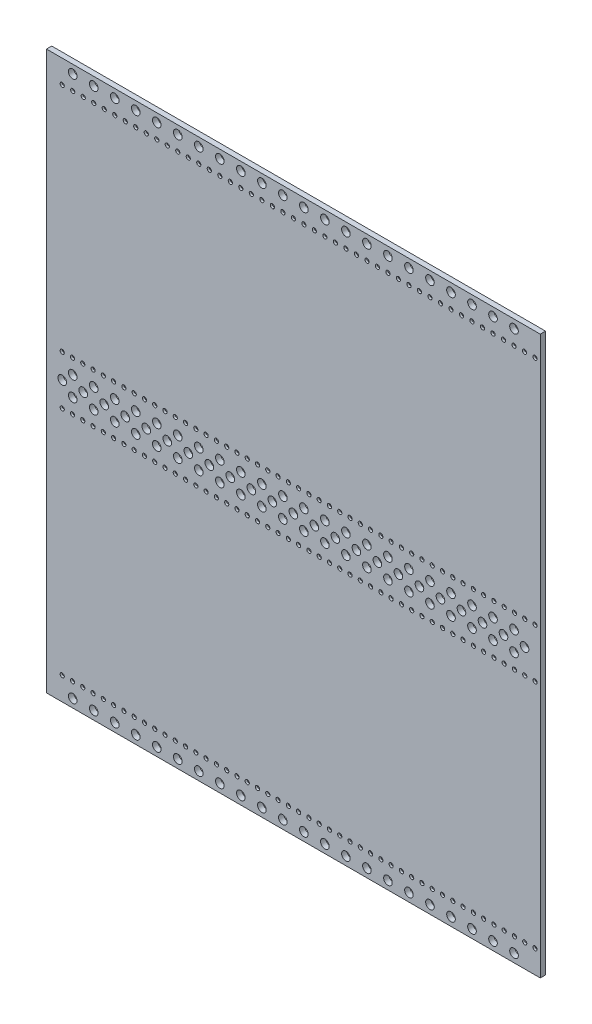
from build123d import *

# Parameters (mm, degrees)
SKETCH_1_W          = 235
SKETCH_1_H          = 265.35
SKETCH_1_R          = 2.05
EXTRUDE_1_DEPTH     = 1.25
SKETCH_2_R          = 1
CUT_EXTRUDE_1_DEPTH = 1
SKETCH_3_R          = 1
EXTRUDE_2_DEPTH     = 1


with BuildPart() as part:
    # Sketch 1 → Extrude 1 (new, symmetric)
    with BuildSketch(Plane.XY):
        Rectangle(SKETCH_1_W, SKETCH_1_H)
        with Locations((-105, 128.675)):
            Circle(SKETCH_1_R, mode=Mode.SUBTRACT)
        with Locations((-95, 128.675)):
            Circle(SKETCH_1_R, mode=Mode.SUBTRACT)
        with Locations((-85, 128.675)):
            Circle(SKETCH_1_R, mode=Mode.SUBTRACT)
        with Locations((-75, 128.675)):
            Circle(SKETCH_1_R, mode=Mode.SUBTRACT)
        with Locations((-65, 128.675)):
            Circle(SKETCH_1_R, mode=Mode.SUBTRACT)
        with Locations((-55, 128.675)):
            Circle(SKETCH_1_R, mode=Mode.SUBTRACT)
        with Locations((-45, 128.675)):
            Circle(SKETCH_1_R, mode=Mode.SUBTRACT)
        with Locations((-35, 128.675)):
            Circle(SKETCH_1_R, mode=Mode.SUBTRACT)
        with Locations((-25, 128.675)):
            Circle(SKETCH_1_R, mode=Mode.SUBTRACT)
        with Locations((-15, 128.675)):
            Circle(SKETCH_1_R, mode=Mode.SUBTRACT)
        with Locations((-5, 128.675)):
            Circle(SKETCH_1_R, mode=Mode.SUBTRACT)
        with Locations((5, 128.675)):
            Circle(SKETCH_1_R, mode=Mode.SUBTRACT)
        with Locations((15, 128.675)):
            Circle(SKETCH_1_R, mode=Mode.SUBTRACT)
        with Locations((25, 128.675)):
            Circle(SKETCH_1_R, mode=Mode.SUBTRACT)
        with Locations((35, 128.675)):
            Circle(SKETCH_1_R, mode=Mode.SUBTRACT)
        with Locations((45, 128.675)):
            Circle(SKETCH_1_R, mode=Mode.SUBTRACT)
        with Locations((55, 128.675)):
            Circle(SKETCH_1_R, mode=Mode.SUBTRACT)
        with Locations((65, 128.675)):
            Circle(SKETCH_1_R, mode=Mode.SUBTRACT)
        with Locations((75, 128.675)):
            Circle(SKETCH_1_R, mode=Mode.SUBTRACT)
        with Locations((85, 128.675)):
            Circle(SKETCH_1_R, mode=Mode.SUBTRACT)
        with Locations((95, 128.675)):
            Circle(SKETCH_1_R, mode=Mode.SUBTRACT)
        with Locations((105, 128.675)):
            Circle(SKETCH_1_R, mode=Mode.SUBTRACT)
        with Locations((-105, 4.675)):
            Circle(SKETCH_1_R, mode=Mode.SUBTRACT)
        with Locations((-105, -4.675)):
            Circle(SKETCH_1_R, mode=Mode.SUBTRACT)
        with Locations((-105, -128.675)):
            Circle(SKETCH_1_R, mode=Mode.SUBTRACT)
        with Locations((-95, 4.675)):
            Circle(SKETCH_1_R, mode=Mode.SUBTRACT)
        with Locations((-95, -4.675)):
            Circle(SKETCH_1_R, mode=Mode.SUBTRACT)
        with Locations((-95, -128.675)):
            Circle(SKETCH_1_R, mode=Mode.SUBTRACT)
        with Locations((-85, 4.675)):
            Circle(SKETCH_1_R, mode=Mode.SUBTRACT)
        with Locations((-85, -4.675)):
            Circle(SKETCH_1_R, mode=Mode.SUBTRACT)
        with Locations((-85, -128.675)):
            Circle(SKETCH_1_R, mode=Mode.SUBTRACT)
        with Locations((-75, 4.675)):
            Circle(SKETCH_1_R, mode=Mode.SUBTRACT)
        with Locations((-75, -4.675)):
            Circle(SKETCH_1_R, mode=Mode.SUBTRACT)
        with Locations((-75, -128.675)):
            Circle(SKETCH_1_R, mode=Mode.SUBTRACT)
        with Locations((-65, 4.675)):
            Circle(SKETCH_1_R, mode=Mode.SUBTRACT)
        with Locations((-65, -4.675)):
            Circle(SKETCH_1_R, mode=Mode.SUBTRACT)
        with Locations((-65, -128.675)):
            Circle(SKETCH_1_R, mode=Mode.SUBTRACT)
        with Locations((-55, 4.675)):
            Circle(SKETCH_1_R, mode=Mode.SUBTRACT)
        with Locations((-55, -4.675)):
            Circle(SKETCH_1_R, mode=Mode.SUBTRACT)
        with Locations((-55, -128.675)):
            Circle(SKETCH_1_R, mode=Mode.SUBTRACT)
        with Locations((-45, 4.675)):
            Circle(SKETCH_1_R, mode=Mode.SUBTRACT)
        with Locations((-45, -4.675)):
            Circle(SKETCH_1_R, mode=Mode.SUBTRACT)
        with Locations((-45, -128.675)):
            Circle(SKETCH_1_R, mode=Mode.SUBTRACT)
        with Locations((-35, 4.675)):
            Circle(SKETCH_1_R, mode=Mode.SUBTRACT)
        with Locations((-35, -4.675)):
            Circle(SKETCH_1_R, mode=Mode.SUBTRACT)
        with Locations((-35, -128.675)):
            Circle(SKETCH_1_R, mode=Mode.SUBTRACT)
        with Locations((-25, 4.675)):
            Circle(SKETCH_1_R, mode=Mode.SUBTRACT)
        with Locations((-25, -4.675)):
            Circle(SKETCH_1_R, mode=Mode.SUBTRACT)
        with Locations((-25, -128.675)):
            Circle(SKETCH_1_R, mode=Mode.SUBTRACT)
        with Locations((-15, 4.675)):
            Circle(SKETCH_1_R, mode=Mode.SUBTRACT)
        with Locations((-15, -4.675)):
            Circle(SKETCH_1_R, mode=Mode.SUBTRACT)
        with Locations((-15, -128.675)):
            Circle(SKETCH_1_R, mode=Mode.SUBTRACT)
        with Locations((-5, 4.675)):
            Circle(SKETCH_1_R, mode=Mode.SUBTRACT)
        with Locations((-5, -4.675)):
            Circle(SKETCH_1_R, mode=Mode.SUBTRACT)
        with Locations((-5, -128.675)):
            Circle(SKETCH_1_R, mode=Mode.SUBTRACT)
        with Locations((5, 4.675)):
            Circle(SKETCH_1_R, mode=Mode.SUBTRACT)
        with Locations((5, -4.675)):
            Circle(SKETCH_1_R, mode=Mode.SUBTRACT)
        with Locations((5, -128.675)):
            Circle(SKETCH_1_R, mode=Mode.SUBTRACT)
        with Locations((15, 4.675)):
            Circle(SKETCH_1_R, mode=Mode.SUBTRACT)
        with Locations((15, -4.675)):
            Circle(SKETCH_1_R, mode=Mode.SUBTRACT)
        with Locations((15, -128.675)):
            Circle(SKETCH_1_R, mode=Mode.SUBTRACT)
        with Locations((25, 4.675)):
            Circle(SKETCH_1_R, mode=Mode.SUBTRACT)
        with Locations((25, -4.675)):
            Circle(SKETCH_1_R, mode=Mode.SUBTRACT)
        with Locations((25, -128.675)):
            Circle(SKETCH_1_R, mode=Mode.SUBTRACT)
        with Locations((35, 4.675)):
            Circle(SKETCH_1_R, mode=Mode.SUBTRACT)
        with Locations((35, -4.675)):
            Circle(SKETCH_1_R, mode=Mode.SUBTRACT)
        with Locations((35, -128.675)):
            Circle(SKETCH_1_R, mode=Mode.SUBTRACT)
        with Locations((45, 4.675)):
            Circle(SKETCH_1_R, mode=Mode.SUBTRACT)
        with Locations((45, -4.675)):
            Circle(SKETCH_1_R, mode=Mode.SUBTRACT)
        with Locations((45, -128.675)):
            Circle(SKETCH_1_R, mode=Mode.SUBTRACT)
        with Locations((55, 4.675)):
            Circle(SKETCH_1_R, mode=Mode.SUBTRACT)
        with Locations((55, -4.675)):
            Circle(SKETCH_1_R, mode=Mode.SUBTRACT)
        with Locations((55, -128.675)):
            Circle(SKETCH_1_R, mode=Mode.SUBTRACT)
        with Locations((65, 4.675)):
            Circle(SKETCH_1_R, mode=Mode.SUBTRACT)
        with Locations((65, -4.675)):
            Circle(SKETCH_1_R, mode=Mode.SUBTRACT)
        with Locations((65, -128.675)):
            Circle(SKETCH_1_R, mode=Mode.SUBTRACT)
        with Locations((75, 4.675)):
            Circle(SKETCH_1_R, mode=Mode.SUBTRACT)
        with Locations((75, -4.675)):
            Circle(SKETCH_1_R, mode=Mode.SUBTRACT)
        with Locations((75, -128.675)):
            Circle(SKETCH_1_R, mode=Mode.SUBTRACT)
        with Locations((85, 4.675)):
            Circle(SKETCH_1_R, mode=Mode.SUBTRACT)
        with Locations((85, -4.675)):
            Circle(SKETCH_1_R, mode=Mode.SUBTRACT)
        with Locations((85, -128.675)):
            Circle(SKETCH_1_R, mode=Mode.SUBTRACT)
        with Locations((95, 4.675)):
            Circle(SKETCH_1_R, mode=Mode.SUBTRACT)
        with Locations((95, -4.675)):
            Circle(SKETCH_1_R, mode=Mode.SUBTRACT)
        with Locations((95, -128.675)):
            Circle(SKETCH_1_R, mode=Mode.SUBTRACT)
        with Locations((105, 4.675)):
            Circle(SKETCH_1_R, mode=Mode.SUBTRACT)
        with Locations((105, -4.675)):
            Circle(SKETCH_1_R, mode=Mode.SUBTRACT)
        with Locations((105, -128.675)):
            Circle(SKETCH_1_R, mode=Mode.SUBTRACT)
        with Locations((-110, 0)):
            Circle(SKETCH_1_R, mode=Mode.SUBTRACT)
        with Locations((-100, 0)):
            Circle(SKETCH_1_R, mode=Mode.SUBTRACT)
        with Locations((-90, 0)):
            Circle(SKETCH_1_R, mode=Mode.SUBTRACT)
        with Locations((-80, 0)):
            Circle(SKETCH_1_R, mode=Mode.SUBTRACT)
        with Locations((-70, 0)):
            Circle(SKETCH_1_R, mode=Mode.SUBTRACT)
        with Locations((-60, 0)):
            Circle(SKETCH_1_R, mode=Mode.SUBTRACT)
        with Locations((-50, 0)):
            Circle(SKETCH_1_R, mode=Mode.SUBTRACT)
        with Locations((-40, 0)):
            Circle(SKETCH_1_R, mode=Mode.SUBTRACT)
        with Locations((-30, 0)):
            Circle(SKETCH_1_R, mode=Mode.SUBTRACT)
        with Locations((-20, 0)):
            Circle(SKETCH_1_R, mode=Mode.SUBTRACT)
        with Locations((-10, 0)):
            Circle(SKETCH_1_R, mode=Mode.SUBTRACT)
        Circle(SKETCH_1_R, mode=Mode.SUBTRACT)
        with Locations((10, 0)):
            Circle(SKETCH_1_R, mode=Mode.SUBTRACT)
        with Locations((20, 0)):
            Circle(SKETCH_1_R, mode=Mode.SUBTRACT)
        with Locations((30, 0)):
            Circle(SKETCH_1_R, mode=Mode.SUBTRACT)
        with Locations((40, 0)):
            Circle(SKETCH_1_R, mode=Mode.SUBTRACT)
        with Locations((50, 0)):
            Circle(SKETCH_1_R, mode=Mode.SUBTRACT)
        with Locations((60, 0)):
            Circle(SKETCH_1_R, mode=Mode.SUBTRACT)
        with Locations((70, 0)):
            Circle(SKETCH_1_R, mode=Mode.SUBTRACT)
        with Locations((80, 0)):
            Circle(SKETCH_1_R, mode=Mode.SUBTRACT)
        with Locations((90, 0)):
            Circle(SKETCH_1_R, mode=Mode.SUBTRACT)
        with Locations((100, 0)):
            Circle(SKETCH_1_R, mode=Mode.SUBTRACT)
        with Locations((110, 0)):
            Circle(SKETCH_1_R, mode=Mode.SUBTRACT)
    extrude(amount=EXTRUDE_1_DEPTH, both=True)

    # Sketch 2 → Cut-Extrude 1 (cut)
    with BuildSketch(Plane.XY.offset(1.25)):
        with Locations((-110, 121.675)):
            Circle(SKETCH_2_R)
        with Locations((-105, 121.675)):
            Circle(SKETCH_2_R)
        with Locations((-100, 121.675)):
            Circle(SKETCH_2_R)
        with Locations((-95, 121.675)):
            Circle(SKETCH_2_R)
        with Locations((-90, 121.675)):
            Circle(SKETCH_2_R)
        with Locations((-85, 121.675)):
            Circle(SKETCH_2_R)
        with Locations((-80, 121.675)):
            Circle(SKETCH_2_R)
        with Locations((-75, 121.675)):
            Circle(SKETCH_2_R)
        with Locations((-70, 121.675)):
            Circle(SKETCH_2_R)
        with Locations((-65, 121.675)):
            Circle(SKETCH_2_R)
        with Locations((-60, 121.675)):
            Circle(SKETCH_2_R)
        with Locations((-55, 121.675)):
            Circle(SKETCH_2_R)
        with Locations((-50, 121.675)):
            Circle(SKETCH_2_R)
        with Locations((-45, 121.675)):
            Circle(SKETCH_2_R)
        with Locations((-40, 121.675)):
            Circle(SKETCH_2_R)
        with Locations((-35, 121.675)):
            Circle(SKETCH_2_R)
        with Locations((-30, 121.675)):
            Circle(SKETCH_2_R)
        with Locations((-25, 121.675)):
            Circle(SKETCH_2_R)
        with Locations((-20, 121.675)):
            Circle(SKETCH_2_R)
        with Locations((-15, 121.675)):
            Circle(SKETCH_2_R)
        with Locations((-10, 121.675)):
            Circle(SKETCH_2_R)
        with Locations((-5, 121.675)):
            Circle(SKETCH_2_R)
        with Locations((0, 121.675)):
            Circle(SKETCH_2_R)
        with Locations((5, 121.675)):
            Circle(SKETCH_2_R)
        with Locations((10, 121.675)):
            Circle(SKETCH_2_R)
        with Locations((15, 121.675)):
            Circle(SKETCH_2_R)
        with Locations((20, 121.675)):
            Circle(SKETCH_2_R)
        with Locations((25, 121.675)):
            Circle(SKETCH_2_R)
        with Locations((30, 121.675)):
            Circle(SKETCH_2_R)
        with Locations((35, 121.675)):
            Circle(SKETCH_2_R)
        with Locations((40, 121.675)):
            Circle(SKETCH_2_R)
        with Locations((45, 121.675)):
            Circle(SKETCH_2_R)
        with Locations((50, 121.675)):
            Circle(SKETCH_2_R)
        with Locations((55, 121.675)):
            Circle(SKETCH_2_R)
        with Locations((60, 121.675)):
            Circle(SKETCH_2_R)
        with Locations((65, 121.675)):
            Circle(SKETCH_2_R)
        with Locations((70, 121.675)):
            Circle(SKETCH_2_R)
        with Locations((75, 121.675)):
            Circle(SKETCH_2_R)
        with Locations((80, 121.675)):
            Circle(SKETCH_2_R)
        with Locations((85, 121.675)):
            Circle(SKETCH_2_R)
        with Locations((90, 121.675)):
            Circle(SKETCH_2_R)
        with Locations((95, 121.675)):
            Circle(SKETCH_2_R)
        with Locations((100, 121.675)):
            Circle(SKETCH_2_R)
        with Locations((105, 121.675)):
            Circle(SKETCH_2_R)
        with Locations((110, 121.675)):
            Circle(SKETCH_2_R)
        with Locations((115, 121.675)):
            Circle(SKETCH_2_R)
        with Locations((120, 121.675)):
            Circle(SKETCH_2_R)
        with Locations((-110, 11.675)):
            Circle(SKETCH_2_R)
        with Locations((-110, -11.675)):
            Circle(SKETCH_2_R)
        with Locations((-110, -121.675)):
            Circle(SKETCH_2_R)
        with Locations((-105.108695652, 11.675)):
            Circle(SKETCH_2_R)
        with Locations((-105.108695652, -11.675)):
            Circle(SKETCH_2_R)
        with Locations((-105.108695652, -121.675)):
            Circle(SKETCH_2_R)
        with Locations((-100.217391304, 11.675)):
            Circle(SKETCH_2_R)
        with Locations((-100.217391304, -11.675)):
            Circle(SKETCH_2_R)
        with Locations((-100.217391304, -121.675)):
            Circle(SKETCH_2_R)
        with Locations((-95.326086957, 11.675)):
            Circle(SKETCH_2_R)
        with Locations((-95.326086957, -11.675)):
            Circle(SKETCH_2_R)
        with Locations((-95.326086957, -121.675)):
            Circle(SKETCH_2_R)
        with Locations((-90.434782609, 11.675)):
            Circle(SKETCH_2_R)
        with Locations((-90.434782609, -11.675)):
            Circle(SKETCH_2_R)
        with Locations((-90.434782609, -121.675)):
            Circle(SKETCH_2_R)
        with Locations((-85.543478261, 11.675)):
            Circle(SKETCH_2_R)
        with Locations((-85.543478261, -11.675)):
            Circle(SKETCH_2_R)
        with Locations((-85.543478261, -121.675)):
            Circle(SKETCH_2_R)
        with Locations((-80.652173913, 11.675)):
            Circle(SKETCH_2_R)
        with Locations((-80.652173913, -11.675)):
            Circle(SKETCH_2_R)
        with Locations((-80.652173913, -121.675)):
            Circle(SKETCH_2_R)
        with Locations((-75.760869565, 11.675)):
            Circle(SKETCH_2_R)
        with Locations((-75.760869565, -11.675)):
            Circle(SKETCH_2_R)
        with Locations((-75.760869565, -121.675)):
            Circle(SKETCH_2_R)
        with Locations((-70.869565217, 11.675)):
            Circle(SKETCH_2_R)
        with Locations((-70.869565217, -11.675)):
            Circle(SKETCH_2_R)
        with Locations((-70.869565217, -121.675)):
            Circle(SKETCH_2_R)
        with Locations((-65.97826087, 11.675)):
            Circle(SKETCH_2_R)
        with Locations((-65.97826087, -11.675)):
            Circle(SKETCH_2_R)
        with Locations((-65.97826087, -121.675)):
            Circle(SKETCH_2_R)
        with Locations((-61.086956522, 11.675)):
            Circle(SKETCH_2_R)
        with Locations((-61.086956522, -11.675)):
            Circle(SKETCH_2_R)
        with Locations((-61.086956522, -121.675)):
            Circle(SKETCH_2_R)
        with Locations((-56.195652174, 11.675)):
            Circle(SKETCH_2_R)
        with Locations((-56.195652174, -11.675)):
            Circle(SKETCH_2_R)
        with Locations((-56.195652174, -121.675)):
            Circle(SKETCH_2_R)
        with Locations((-51.304347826, 11.675)):
            Circle(SKETCH_2_R)
        with Locations((-51.304347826, -11.675)):
            Circle(SKETCH_2_R)
        with Locations((-51.304347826, -121.675)):
            Circle(SKETCH_2_R)
        with Locations((-46.413043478, 11.675)):
            Circle(SKETCH_2_R)
        with Locations((-46.413043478, -11.675)):
            Circle(SKETCH_2_R)
        with Locations((-46.413043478, -121.675)):
            Circle(SKETCH_2_R)
        with Locations((-41.52173913, 11.675)):
            Circle(SKETCH_2_R)
        with Locations((-41.52173913, -11.675)):
            Circle(SKETCH_2_R)
        with Locations((-41.52173913, -121.675)):
            Circle(SKETCH_2_R)
        with Locations((-36.630434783, 11.675)):
            Circle(SKETCH_2_R)
        with Locations((-36.630434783, -11.675)):
            Circle(SKETCH_2_R)
        with Locations((-36.630434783, -121.675)):
            Circle(SKETCH_2_R)
        with Locations((-31.739130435, 11.675)):
            Circle(SKETCH_2_R)
        with Locations((-31.739130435, -11.675)):
            Circle(SKETCH_2_R)
        with Locations((-31.739130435, -121.675)):
            Circle(SKETCH_2_R)
        with Locations((-26.847826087, 11.675)):
            Circle(SKETCH_2_R)
        with Locations((-26.847826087, -11.675)):
            Circle(SKETCH_2_R)
        with Locations((-26.847826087, -121.675)):
            Circle(SKETCH_2_R)
        with Locations((-21.956521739, 11.675)):
            Circle(SKETCH_2_R)
        with Locations((-21.956521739, -11.675)):
            Circle(SKETCH_2_R)
        with Locations((-21.956521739, -121.675)):
            Circle(SKETCH_2_R)
        with Locations((-17.065217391, 11.675)):
            Circle(SKETCH_2_R)
        with Locations((-17.065217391, -11.675)):
            Circle(SKETCH_2_R)
        with Locations((-17.065217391, -121.675)):
            Circle(SKETCH_2_R)
        with Locations((-12.173913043, 11.675)):
            Circle(SKETCH_2_R)
        with Locations((-12.173913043, -11.675)):
            Circle(SKETCH_2_R)
        with Locations((-12.173913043, -121.675)):
            Circle(SKETCH_2_R)
        with Locations((-7.282608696, 11.675)):
            Circle(SKETCH_2_R)
        with Locations((-7.282608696, -11.675)):
            Circle(SKETCH_2_R)
        with Locations((-7.282608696, -121.675)):
            Circle(SKETCH_2_R)
        with Locations((-2.391304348, 11.675)):
            Circle(SKETCH_2_R)
        with Locations((-2.391304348, -11.675)):
            Circle(SKETCH_2_R)
        with Locations((-2.391304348, -121.675)):
            Circle(SKETCH_2_R)
        with Locations((2.5, 11.675)):
            Circle(SKETCH_2_R)
        with Locations((2.5, -11.675)):
            Circle(SKETCH_2_R)
        with Locations((2.5, -121.675)):
            Circle(SKETCH_2_R)
        with Locations((7.391304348, 11.675)):
            Circle(SKETCH_2_R)
        with Locations((7.391304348, -11.675)):
            Circle(SKETCH_2_R)
        with Locations((7.391304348, -121.675)):
            Circle(SKETCH_2_R)
        with Locations((12.282608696, 11.675)):
            Circle(SKETCH_2_R)
        with Locations((12.282608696, -11.675)):
            Circle(SKETCH_2_R)
        with Locations((12.282608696, -121.675)):
            Circle(SKETCH_2_R)
        with Locations((17.173913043, 11.675)):
            Circle(SKETCH_2_R)
        with Locations((17.173913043, -11.675)):
            Circle(SKETCH_2_R)
        with Locations((17.173913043, -121.675)):
            Circle(SKETCH_2_R)
        with Locations((22.065217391, 11.675)):
            Circle(SKETCH_2_R)
        with Locations((22.065217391, -11.675)):
            Circle(SKETCH_2_R)
        with Locations((22.065217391, -121.675)):
            Circle(SKETCH_2_R)
        with Locations((26.956521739, 11.675)):
            Circle(SKETCH_2_R)
        with Locations((26.956521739, -11.675)):
            Circle(SKETCH_2_R)
        with Locations((26.956521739, -121.675)):
            Circle(SKETCH_2_R)
        with Locations((31.847826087, 11.675)):
            Circle(SKETCH_2_R)
        with Locations((31.847826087, -11.675)):
            Circle(SKETCH_2_R)
        with Locations((31.847826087, -121.675)):
            Circle(SKETCH_2_R)
        with Locations((36.739130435, 11.675)):
            Circle(SKETCH_2_R)
        with Locations((36.739130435, -11.675)):
            Circle(SKETCH_2_R)
        with Locations((36.739130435, -121.675)):
            Circle(SKETCH_2_R)
        with Locations((41.630434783, 11.675)):
            Circle(SKETCH_2_R)
        with Locations((41.630434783, -11.675)):
            Circle(SKETCH_2_R)
        with Locations((41.630434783, -121.675)):
            Circle(SKETCH_2_R)
        with Locations((46.52173913, 11.675)):
            Circle(SKETCH_2_R)
        with Locations((46.52173913, -11.675)):
            Circle(SKETCH_2_R)
        with Locations((46.52173913, -121.675)):
            Circle(SKETCH_2_R)
        with Locations((51.413043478, 11.675)):
            Circle(SKETCH_2_R)
        with Locations((51.413043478, -11.675)):
            Circle(SKETCH_2_R)
        with Locations((51.413043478, -121.675)):
            Circle(SKETCH_2_R)
        with Locations((56.304347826, 11.675)):
            Circle(SKETCH_2_R)
        with Locations((56.304347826, -11.675)):
            Circle(SKETCH_2_R)
        with Locations((56.304347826, -121.675)):
            Circle(SKETCH_2_R)
        with Locations((61.195652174, 11.675)):
            Circle(SKETCH_2_R)
        with Locations((61.195652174, -11.675)):
            Circle(SKETCH_2_R)
        with Locations((61.195652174, -121.675)):
            Circle(SKETCH_2_R)
        with Locations((66.086956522, 11.675)):
            Circle(SKETCH_2_R)
        with Locations((66.086956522, -11.675)):
            Circle(SKETCH_2_R)
        with Locations((66.086956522, -121.675)):
            Circle(SKETCH_2_R)
        with Locations((70.97826087, 11.675)):
            Circle(SKETCH_2_R)
        with Locations((70.97826087, -11.675)):
            Circle(SKETCH_2_R)
        with Locations((70.97826087, -121.675)):
            Circle(SKETCH_2_R)
        with Locations((75.869565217, 11.675)):
            Circle(SKETCH_2_R)
        with Locations((75.869565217, -11.675)):
            Circle(SKETCH_2_R)
        with Locations((75.869565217, -121.675)):
            Circle(SKETCH_2_R)
        with Locations((80.760869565, 11.675)):
            Circle(SKETCH_2_R)
        with Locations((80.760869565, -11.675)):
            Circle(SKETCH_2_R)
        with Locations((80.760869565, -121.675)):
            Circle(SKETCH_2_R)
        with Locations((85.652173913, 11.675)):
            Circle(SKETCH_2_R)
        with Locations((85.652173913, -11.675)):
            Circle(SKETCH_2_R)
        with Locations((85.652173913, -121.675)):
            Circle(SKETCH_2_R)
        with Locations((90.543478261, 11.675)):
            Circle(SKETCH_2_R)
        with Locations((90.543478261, -11.675)):
            Circle(SKETCH_2_R)
        with Locations((90.543478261, -121.675)):
            Circle(SKETCH_2_R)
        with Locations((95.434782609, 11.675)):
            Circle(SKETCH_2_R)
        with Locations((95.434782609, -11.675)):
            Circle(SKETCH_2_R)
        with Locations((95.434782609, -121.675)):
            Circle(SKETCH_2_R)
        with Locations((100.326086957, 11.675)):
            Circle(SKETCH_2_R)
        with Locations((100.326086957, -11.675)):
            Circle(SKETCH_2_R)
        with Locations((100.326086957, -121.675)):
            Circle(SKETCH_2_R)
        with Locations((105.217391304, 11.675)):
            Circle(SKETCH_2_R)
        with Locations((105.217391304, -11.675)):
            Circle(SKETCH_2_R)
        with Locations((105.217391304, -121.675)):
            Circle(SKETCH_2_R)
        with Locations((110.108695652, 11.675)):
            Circle(SKETCH_2_R)
        with Locations((110.108695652, -11.675)):
            Circle(SKETCH_2_R)
        with Locations((110.108695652, -121.675)):
            Circle(SKETCH_2_R)
        with Locations((115, 11.675)):
            Circle(SKETCH_2_R)
        with Locations((115, -11.675)):
            Circle(SKETCH_2_R)
        with Locations((115, -121.675)):
            Circle(SKETCH_2_R)
    extrude(amount=-CUT_EXTRUDE_1_DEPTH, mode=Mode.SUBTRACT)

    # Sketch 3 → Extrude 2 (add)
    with BuildSketch(Plane(origin=(0, 0, -1.25), x_dir=(-1, 0, 0), z_dir=(0, 0, -1))):
        with Locations(Location((110, 121.675, 0), (0, 0, 180))):
            Circle(SKETCH_3_R)
        with Locations(Location((110, 11.675, 0), (0, 0, 180))):
            Circle(SKETCH_3_R)
        with Locations(Location((110, -11.675, 0), (0, 0, 180))):
            Circle(SKETCH_3_R)
        with Locations(Location((110, -121.675, 0), (0, 0, 180))):
            Circle(SKETCH_3_R)
        with Locations(Location((105.217391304, 121.675, 0), (0, 0, 180))):
            Circle(SKETCH_3_R)
        with Locations(Location((105.217391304, 11.675, 0), (0, 0, 180))):
            Circle(SKETCH_3_R)
        with Locations(Location((105.217391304, -11.675, 0), (0, 0, 180))):
            Circle(SKETCH_3_R)
        with Locations(Location((105.217391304, -121.675, 0), (0, 0, 180))):
            Circle(SKETCH_3_R)
        with Locations(Location((100.434782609, 121.675, 0), (0, 0, 180))):
            Circle(SKETCH_3_R)
        with Locations(Location((100.434782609, 11.675, 0), (0, 0, 180))):
            Circle(SKETCH_3_R)
        with Locations(Location((100.434782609, -11.675, 0), (0, 0, 180))):
            Circle(SKETCH_3_R)
        with Locations(Location((100.434782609, -121.675, 0), (0, 0, 180))):
            Circle(SKETCH_3_R)
        with Locations(Location((95.652173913, 121.675, 0), (0, 0, 180))):
            Circle(SKETCH_3_R)
        with Locations(Location((95.652173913, 11.675, 0), (0, 0, 180))):
            Circle(SKETCH_3_R)
        with Locations(Location((95.652173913, -11.675, 0), (0, 0, 180))):
            Circle(SKETCH_3_R)
        with Locations(Location((95.652173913, -121.675, 0), (0, 0, 180))):
            Circle(SKETCH_3_R)
        with Locations(Location((90.869565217, 121.675, 0), (0, 0, 180))):
            Circle(SKETCH_3_R)
        with Locations(Location((90.869565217, 11.675, 0), (0, 0, 180))):
            Circle(SKETCH_3_R)
        with Locations(Location((90.869565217, -11.675, 0), (0, 0, 180))):
            Circle(SKETCH_3_R)
        with Locations(Location((90.869565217, -121.675, 0), (0, 0, 180))):
            Circle(SKETCH_3_R)
        with Locations(Location((86.086956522, 121.675, 0), (0, 0, 180))):
            Circle(SKETCH_3_R)
        with Locations(Location((86.086956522, 11.675, 0), (0, 0, 180))):
            Circle(SKETCH_3_R)
        with Locations(Location((86.086956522, -11.675, 0), (0, 0, 180))):
            Circle(SKETCH_3_R)
        with Locations(Location((86.086956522, -121.675, 0), (0, 0, 180))):
            Circle(SKETCH_3_R)
        with Locations(Location((81.304347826, 121.675, 0), (0, 0, 180))):
            Circle(SKETCH_3_R)
        with Locations(Location((81.304347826, 11.675, 0), (0, 0, 180))):
            Circle(SKETCH_3_R)
        with Locations(Location((81.304347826, -11.675, 0), (0, 0, 180))):
            Circle(SKETCH_3_R)
        with Locations(Location((81.304347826, -121.675, 0), (0, 0, 180))):
            Circle(SKETCH_3_R)
        with Locations(Location((76.52173913, 121.675, 0), (0, 0, 180))):
            Circle(SKETCH_3_R)
        with Locations(Location((76.52173913, 11.675, 0), (0, 0, 180))):
            Circle(SKETCH_3_R)
        with Locations(Location((76.52173913, -11.675, 0), (0, 0, 180))):
            Circle(SKETCH_3_R)
        with Locations(Location((76.52173913, -121.675, 0), (0, 0, 180))):
            Circle(SKETCH_3_R)
        with Locations(Location((71.739130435, 121.675, 0), (0, 0, 180))):
            Circle(SKETCH_3_R)
        with Locations(Location((71.739130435, 11.675, 0), (0, 0, 180))):
            Circle(SKETCH_3_R)
        with Locations(Location((71.739130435, -11.675, 0), (0, 0, 180))):
            Circle(SKETCH_3_R)
        with Locations(Location((71.739130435, -121.675, 0), (0, 0, 180))):
            Circle(SKETCH_3_R)
        with Locations(Location((66.956521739, 121.675, 0), (0, 0, 180))):
            Circle(SKETCH_3_R)
        with Locations(Location((66.956521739, 11.675, 0), (0, 0, 180))):
            Circle(SKETCH_3_R)
        with Locations(Location((66.956521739, -11.675, 0), (0, 0, 180))):
            Circle(SKETCH_3_R)
        with Locations(Location((66.956521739, -121.675, 0), (0, 0, 180))):
            Circle(SKETCH_3_R)
        with Locations(Location((62.173913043, 121.675, 0), (0, 0, 180))):
            Circle(SKETCH_3_R)
        with Locations(Location((62.173913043, 11.675, 0), (0, 0, 180))):
            Circle(SKETCH_3_R)
        with Locations(Location((62.173913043, -11.675, 0), (0, 0, 180))):
            Circle(SKETCH_3_R)
        with Locations(Location((62.173913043, -121.675, 0), (0, 0, 180))):
            Circle(SKETCH_3_R)
        with Locations(Location((57.391304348, 121.675, 0), (0, 0, 180))):
            Circle(SKETCH_3_R)
        with Locations(Location((57.391304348, 11.675, 0), (0, 0, 180))):
            Circle(SKETCH_3_R)
        with Locations(Location((57.391304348, -11.675, 0), (0, 0, 180))):
            Circle(SKETCH_3_R)
        with Locations(Location((57.391304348, -121.675, 0), (0, 0, 180))):
            Circle(SKETCH_3_R)
        with Locations(Location((52.608695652, 121.675, 0), (0, 0, 180))):
            Circle(SKETCH_3_R)
        with Locations(Location((52.608695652, 11.675, 0), (0, 0, 180))):
            Circle(SKETCH_3_R)
        with Locations(Location((52.608695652, -11.675, 0), (0, 0, 180))):
            Circle(SKETCH_3_R)
        with Locations(Location((52.608695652, -121.675, 0), (0, 0, 180))):
            Circle(SKETCH_3_R)
        with Locations(Location((47.826086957, 121.675, 0), (0, 0, 180))):
            Circle(SKETCH_3_R)
        with Locations(Location((47.826086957, 11.675, 0), (0, 0, 180))):
            Circle(SKETCH_3_R)
        with Locations(Location((47.826086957, -11.675, 0), (0, 0, 180))):
            Circle(SKETCH_3_R)
        with Locations(Location((47.826086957, -121.675, 0), (0, 0, 180))):
            Circle(SKETCH_3_R)
        with Locations(Location((43.043478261, 121.675, 0), (0, 0, 180))):
            Circle(SKETCH_3_R)
        with Locations(Location((43.043478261, 11.675, 0), (0, 0, 180))):
            Circle(SKETCH_3_R)
        with Locations(Location((43.043478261, -11.675, 0), (0, 0, 180))):
            Circle(SKETCH_3_R)
        with Locations(Location((43.043478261, -121.675, 0), (0, 0, 180))):
            Circle(SKETCH_3_R)
        with Locations(Location((38.260869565, 121.675, 0), (0, 0, 180))):
            Circle(SKETCH_3_R)
        with Locations(Location((38.260869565, 11.675, 0), (0, 0, 180))):
            Circle(SKETCH_3_R)
        with Locations(Location((38.260869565, -11.675, 0), (0, 0, 180))):
            Circle(SKETCH_3_R)
        with Locations(Location((38.260869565, -121.675, 0), (0, 0, 180))):
            Circle(SKETCH_3_R)
        with Locations(Location((33.47826087, 121.675, 0), (0, 0, 180))):
            Circle(SKETCH_3_R)
        with Locations(Location((33.47826087, 11.675, 0), (0, 0, 180))):
            Circle(SKETCH_3_R)
        with Locations(Location((33.47826087, -11.675, 0), (0, 0, 180))):
            Circle(SKETCH_3_R)
        with Locations(Location((33.47826087, -121.675, 0), (0, 0, 180))):
            Circle(SKETCH_3_R)
        with Locations(Location((28.695652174, 121.675, 0), (0, 0, 180))):
            Circle(SKETCH_3_R)
        with Locations(Location((28.695652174, 11.675, 0), (0, 0, 180))):
            Circle(SKETCH_3_R)
        with Locations(Location((28.695652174, -11.675, 0), (0, 0, 180))):
            Circle(SKETCH_3_R)
        with Locations(Location((28.695652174, -121.675, 0), (0, 0, 180))):
            Circle(SKETCH_3_R)
        with Locations(Location((23.913043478, 121.675, 0), (0, 0, 180))):
            Circle(SKETCH_3_R)
        with Locations(Location((23.913043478, 11.675, 0), (0, 0, 180))):
            Circle(SKETCH_3_R)
        with Locations(Location((23.913043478, -11.675, 0), (0, 0, 180))):
            Circle(SKETCH_3_R)
        with Locations(Location((23.913043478, -121.675, 0), (0, 0, 180))):
            Circle(SKETCH_3_R)
        with Locations(Location((19.130434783, 121.675, 0), (0, 0, 180))):
            Circle(SKETCH_3_R)
        with Locations(Location((19.130434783, 11.675, 0), (0, 0, 180))):
            Circle(SKETCH_3_R)
        with Locations(Location((19.130434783, -11.675, 0), (0, 0, 180))):
            Circle(SKETCH_3_R)
        with Locations(Location((19.130434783, -121.675, 0), (0, 0, 180))):
            Circle(SKETCH_3_R)
        with Locations(Location((14.347826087, 121.675, 0), (0, 0, 180))):
            Circle(SKETCH_3_R)
        with Locations(Location((14.347826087, 11.675, 0), (0, 0, 180))):
            Circle(SKETCH_3_R)
        with Locations(Location((14.347826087, -11.675, 0), (0, 0, 180))):
            Circle(SKETCH_3_R)
        with Locations(Location((14.347826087, -121.675, 0), (0, 0, 180))):
            Circle(SKETCH_3_R)
        with Locations(Location((9.565217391, 121.675, 0), (0, 0, 180))):
            Circle(SKETCH_3_R)
        with Locations(Location((9.565217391, 11.675, 0), (0, 0, 180))):
            Circle(SKETCH_3_R)
        with Locations(Location((9.565217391, -11.675, 0), (0, 0, 180))):
            Circle(SKETCH_3_R)
        with Locations(Location((9.565217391, -121.675, 0), (0, 0, 180))):
            Circle(SKETCH_3_R)
        with Locations(Location((4.782608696, 121.675, 0), (0, 0, 180))):
            Circle(SKETCH_3_R)
        with Locations(Location((4.782608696, 11.675, 0), (0, 0, 180))):
            Circle(SKETCH_3_R)
        with Locations(Location((4.782608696, -11.675, 0), (0, 0, 180))):
            Circle(SKETCH_3_R)
        with Locations(Location((4.782608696, -121.675, 0), (0, 0, 180))):
            Circle(SKETCH_3_R)
        with Locations(Location((0, 121.675, 0), (0, 0, 180))):
            Circle(SKETCH_3_R)
        with Locations(Location((0, 11.675, 0), (0, 0, 180))):
            Circle(SKETCH_3_R)
        with Locations(Location((0, -11.675, 0), (0, 0, 180))):
            Circle(SKETCH_3_R)
        with Locations(Location((0, -121.675, 0), (0, 0, 180))):
            Circle(SKETCH_3_R)
        with Locations(Location((-4.782608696, 121.675, 0), (0, 0, 180))):
            Circle(SKETCH_3_R)
        with Locations(Location((-4.782608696, 11.675, 0), (0, 0, 180))):
            Circle(SKETCH_3_R)
        with Locations(Location((-4.782608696, -11.675, 0), (0, 0, 180))):
            Circle(SKETCH_3_R)
        with Locations(Location((-4.782608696, -121.675, 0), (0, 0, 180))):
            Circle(SKETCH_3_R)
        with Locations(Location((-9.565217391, 121.675, 0), (0, 0, 180))):
            Circle(SKETCH_3_R)
        with Locations(Location((-9.565217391, 11.675, 0), (0, 0, 180))):
            Circle(SKETCH_3_R)
        with Locations(Location((-9.565217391, -11.675, 0), (0, 0, 180))):
            Circle(SKETCH_3_R)
        with Locations(Location((-9.565217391, -121.675, 0), (0, 0, 180))):
            Circle(SKETCH_3_R)
        with Locations(Location((-14.347826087, 121.675, 0), (0, 0, 180))):
            Circle(SKETCH_3_R)
        with Locations(Location((-14.347826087, 11.675, 0), (0, 0, 180))):
            Circle(SKETCH_3_R)
        with Locations(Location((-14.347826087, -11.675, 0), (0, 0, 180))):
            Circle(SKETCH_3_R)
        with Locations(Location((-14.347826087, -121.675, 0), (0, 0, 180))):
            Circle(SKETCH_3_R)
        with Locations(Location((-19.130434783, 121.675, 0), (0, 0, 180))):
            Circle(SKETCH_3_R)
        with Locations(Location((-19.130434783, 11.675, 0), (0, 0, 180))):
            Circle(SKETCH_3_R)
        with Locations(Location((-19.130434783, -11.675, 0), (0, 0, 180))):
            Circle(SKETCH_3_R)
        with Locations(Location((-19.130434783, -121.675, 0), (0, 0, 180))):
            Circle(SKETCH_3_R)
        with Locations(Location((-23.913043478, 121.675, 0), (0, 0, 180))):
            Circle(SKETCH_3_R)
        with Locations(Location((-23.913043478, 11.675, 0), (0, 0, 180))):
            Circle(SKETCH_3_R)
        with Locations(Location((-23.913043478, -11.675, 0), (0, 0, 180))):
            Circle(SKETCH_3_R)
        with Locations(Location((-23.913043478, -121.675, 0), (0, 0, 180))):
            Circle(SKETCH_3_R)
        with Locations(Location((-28.695652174, 121.675, 0), (0, 0, 180))):
            Circle(SKETCH_3_R)
        with Locations(Location((-28.695652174, 11.675, 0), (0, 0, 180))):
            Circle(SKETCH_3_R)
        with Locations(Location((-28.695652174, -11.675, 0), (0, 0, 180))):
            Circle(SKETCH_3_R)
        with Locations(Location((-28.695652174, -121.675, 0), (0, 0, 180))):
            Circle(SKETCH_3_R)
        with Locations(Location((-33.47826087, 121.675, 0), (0, 0, 180))):
            Circle(SKETCH_3_R)
        with Locations(Location((-33.47826087, 11.675, 0), (0, 0, 180))):
            Circle(SKETCH_3_R)
        with Locations(Location((-33.47826087, -11.675, 0), (0, 0, 180))):
            Circle(SKETCH_3_R)
        with Locations(Location((-33.47826087, -121.675, 0), (0, 0, 180))):
            Circle(SKETCH_3_R)
        with Locations(Location((-38.260869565, 121.675, 0), (0, 0, 180))):
            Circle(SKETCH_3_R)
        with Locations(Location((-38.260869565, 11.675, 0), (0, 0, 180))):
            Circle(SKETCH_3_R)
        with Locations(Location((-38.260869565, -11.675, 0), (0, 0, 180))):
            Circle(SKETCH_3_R)
        with Locations(Location((-38.260869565, -121.675, 0), (0, 0, 180))):
            Circle(SKETCH_3_R)
        with Locations(Location((-43.043478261, 121.675, 0), (0, 0, 180))):
            Circle(SKETCH_3_R)
        with Locations(Location((-43.043478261, 11.675, 0), (0, 0, 180))):
            Circle(SKETCH_3_R)
        with Locations(Location((-43.043478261, -11.675, 0), (0, 0, 180))):
            Circle(SKETCH_3_R)
        with Locations(Location((-43.043478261, -121.675, 0), (0, 0, 180))):
            Circle(SKETCH_3_R)
        with Locations(Location((-47.826086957, 121.675, 0), (0, 0, 180))):
            Circle(SKETCH_3_R)
        with Locations(Location((-47.826086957, 11.675, 0), (0, 0, 180))):
            Circle(SKETCH_3_R)
        with Locations(Location((-47.826086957, -11.675, 0), (0, 0, 180))):
            Circle(SKETCH_3_R)
        with Locations(Location((-47.826086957, -121.675, 0), (0, 0, 180))):
            Circle(SKETCH_3_R)
        with Locations(Location((-52.608695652, 121.675, 0), (0, 0, 180))):
            Circle(SKETCH_3_R)
        with Locations(Location((-52.608695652, 11.675, 0), (0, 0, 180))):
            Circle(SKETCH_3_R)
        with Locations(Location((-52.608695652, -11.675, 0), (0, 0, 180))):
            Circle(SKETCH_3_R)
        with Locations(Location((-52.608695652, -121.675, 0), (0, 0, 180))):
            Circle(SKETCH_3_R)
        with Locations(Location((-57.391304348, 121.675, 0), (0, 0, 180))):
            Circle(SKETCH_3_R)
        with Locations(Location((-57.391304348, 11.675, 0), (0, 0, 180))):
            Circle(SKETCH_3_R)
        with Locations(Location((-57.391304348, -11.675, 0), (0, 0, 180))):
            Circle(SKETCH_3_R)
        with Locations(Location((-57.391304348, -121.675, 0), (0, 0, 180))):
            Circle(SKETCH_3_R)
        with Locations(Location((-62.173913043, 121.675, 0), (0, 0, 180))):
            Circle(SKETCH_3_R)
        with Locations(Location((-62.173913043, 11.675, 0), (0, 0, 180))):
            Circle(SKETCH_3_R)
        with Locations(Location((-62.173913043, -11.675, 0), (0, 0, 180))):
            Circle(SKETCH_3_R)
        with Locations(Location((-62.173913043, -121.675, 0), (0, 0, 180))):
            Circle(SKETCH_3_R)
        with Locations(Location((-66.956521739, 121.675, 0), (0, 0, 180))):
            Circle(SKETCH_3_R)
        with Locations(Location((-66.956521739, 11.675, 0), (0, 0, 180))):
            Circle(SKETCH_3_R)
        with Locations(Location((-66.956521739, -11.675, 0), (0, 0, 180))):
            Circle(SKETCH_3_R)
        with Locations(Location((-66.956521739, -121.675, 0), (0, 0, 180))):
            Circle(SKETCH_3_R)
        with Locations(Location((-71.739130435, 121.675, 0), (0, 0, 180))):
            Circle(SKETCH_3_R)
        with Locations(Location((-71.739130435, 11.675, 0), (0, 0, 180))):
            Circle(SKETCH_3_R)
        with Locations(Location((-71.739130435, -11.675, 0), (0, 0, 180))):
            Circle(SKETCH_3_R)
        with Locations(Location((-71.739130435, -121.675, 0), (0, 0, 180))):
            Circle(SKETCH_3_R)
        with Locations(Location((-76.52173913, 121.675, 0), (0, 0, 180))):
            Circle(SKETCH_3_R)
        with Locations(Location((-76.52173913, 11.675, 0), (0, 0, 180))):
            Circle(SKETCH_3_R)
        with Locations(Location((-76.52173913, -11.675, 0), (0, 0, 180))):
            Circle(SKETCH_3_R)
        with Locations(Location((-76.52173913, -121.675, 0), (0, 0, 180))):
            Circle(SKETCH_3_R)
        with Locations(Location((-81.304347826, 121.675, 0), (0, 0, 180))):
            Circle(SKETCH_3_R)
        with Locations(Location((-81.304347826, 11.675, 0), (0, 0, 180))):
            Circle(SKETCH_3_R)
        with Locations(Location((-81.304347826, -11.675, 0), (0, 0, 180))):
            Circle(SKETCH_3_R)
        with Locations(Location((-81.304347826, -121.675, 0), (0, 0, 180))):
            Circle(SKETCH_3_R)
        with Locations(Location((-86.086956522, 121.675, 0), (0, 0, 180))):
            Circle(SKETCH_3_R)
        with Locations(Location((-86.086956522, 11.675, 0), (0, 0, 180))):
            Circle(SKETCH_3_R)
        with Locations(Location((-86.086956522, -11.675, 0), (0, 0, 180))):
            Circle(SKETCH_3_R)
        with Locations(Location((-86.086956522, -121.675, 0), (0, 0, 180))):
            Circle(SKETCH_3_R)
        with Locations(Location((-90.869565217, 121.675, 0), (0, 0, 180))):
            Circle(SKETCH_3_R)
        with Locations(Location((-90.869565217, 11.675, 0), (0, 0, 180))):
            Circle(SKETCH_3_R)
        with Locations(Location((-90.869565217, -11.675, 0), (0, 0, 180))):
            Circle(SKETCH_3_R)
        with Locations(Location((-90.869565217, -121.675, 0), (0, 0, 180))):
            Circle(SKETCH_3_R)
        with Locations(Location((-95.652173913, 121.675, 0), (0, 0, 180))):
            Circle(SKETCH_3_R)
        with Locations(Location((-95.652173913, 11.675, 0), (0, 0, 180))):
            Circle(SKETCH_3_R)
        with Locations(Location((-95.652173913, -11.675, 0), (0, 0, 180))):
            Circle(SKETCH_3_R)
        with Locations(Location((-95.652173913, -121.675, 0), (0, 0, 180))):
            Circle(SKETCH_3_R)
        with Locations(Location((-100.434782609, 121.675, 0), (0, 0, 180))):
            Circle(SKETCH_3_R)
        with Locations(Location((-100.434782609, 11.675, 0), (0, 0, 180))):
            Circle(SKETCH_3_R)
        with Locations(Location((-100.434782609, -11.675, 0), (0, 0, 180))):
            Circle(SKETCH_3_R)
        with Locations(Location((-100.434782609, -121.675, 0), (0, 0, 180))):
            Circle(SKETCH_3_R)
        with Locations(Location((-105.217391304, 121.675, 0), (0, 0, 180))):
            Circle(SKETCH_3_R)
        with Locations(Location((-105.217391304, 11.675, 0), (0, 0, 180))):
            Circle(SKETCH_3_R)
        with Locations(Location((-105.217391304, -11.675, 0), (0, 0, 180))):
            Circle(SKETCH_3_R)
        with Locations(Location((-105.217391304, -121.675, 0), (0, 0, 180))):
            Circle(SKETCH_3_R)
        with Locations(Location((-110, 121.675, 0), (0, 0, 180))):
            Circle(SKETCH_3_R)
        with Locations(Location((-110, 11.675, 0), (0, 0, 180))):
            Circle(SKETCH_3_R)
        with Locations(Location((-110, -11.675, 0), (0, 0, 180))):
            Circle(SKETCH_3_R)
        with Locations(Location((-110, -121.675, 0), (0, 0, 180))):
            Circle(SKETCH_3_R)
    extrude(amount=EXTRUDE_2_DEPTH)


solid = part.part
